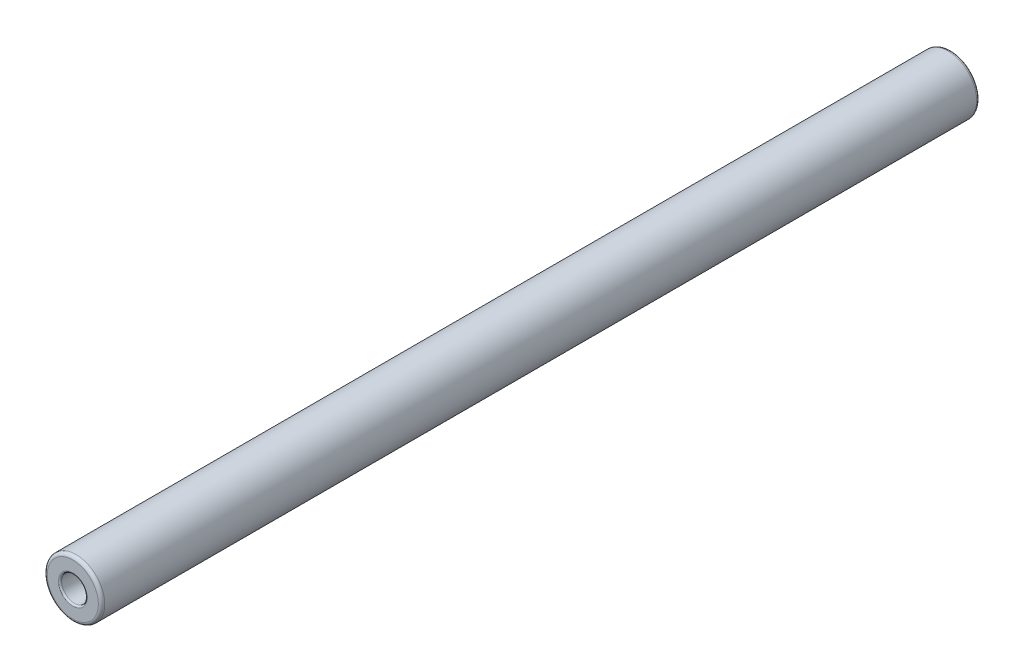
ISO-10303-21;
HEADER;
FILE_DESCRIPTION(('STEP AP214'),'2;1');
FILE_NAME('part.step','',(''),(''),'','','');
FILE_SCHEMA(('AUTOMOTIVE_DESIGN { 1 0 10303 214 1 1 1 1 }'));
ENDSEC;
DATA;
#1=APPLICATION_CONTEXT('core data for automotive mechanical design processes');
#2=APPLICATION_PROTOCOL_DEFINITION('international standard','automotive_design',2000,#1);
#3=PRODUCT_CONTEXT('',#1,'mechanical');
#4=PRODUCT('Part','Part','',(#3));
#5=PRODUCT_RELATED_PRODUCT_CATEGORY('part','',(#4));
#6=PRODUCT_DEFINITION_FORMATION('','',#4);
#7=PRODUCT_DEFINITION_CONTEXT('part definition',#1,'design');
#8=PRODUCT_DEFINITION('design','',#6,#7);
#9=PRODUCT_DEFINITION_SHAPE('','',#8);
#10=(LENGTH_UNIT() NAMED_UNIT(*) SI_UNIT(.MILLI.,.METRE.));
#11=(NAMED_UNIT(*) PLANE_ANGLE_UNIT() SI_UNIT($,.RADIAN.));
#12=(NAMED_UNIT(*) SI_UNIT($,.STERADIAN.) SOLID_ANGLE_UNIT());
#13=UNCERTAINTY_MEASURE_WITH_UNIT(LENGTH_MEASURE(1.E-05),#10,'distance_accuracy_value','');
#14=(GEOMETRIC_REPRESENTATION_CONTEXT(3) GLOBAL_UNCERTAINTY_ASSIGNED_CONTEXT((#13)) GLOBAL_UNIT_ASSIGNED_CONTEXT((#10,
#11,#12)) REPRESENTATION_CONTEXT('',''));
#15=CARTESIAN_POINT('',(0.,0.,0.));
#16=DIRECTION('',(0.,0.,1.));
#17=DIRECTION('',(1.,0.,0.));
#18=AXIS2_PLACEMENT_3D('',#15,#16,#17);
#19=CARTESIAN_POINT('',(0.,0.,0.));
#20=DIRECTION('',(0.,0.,1.));
#21=DIRECTION('',(1.,0.,0.));
#22=AXIS2_PLACEMENT_3D('',#19,#20,#21);
#23=PLANE('',#22);
#24=CARTESIAN_POINT('',(0.,0.,0.));
#25=DIRECTION('',(0.,0.,1.));
#26=DIRECTION('',(1.,0.,0.));
#27=AXIS2_PLACEMENT_3D('',#24,#25,#26);
#28=CIRCLE('',#27,9.);
#29=CARTESIAN_POINT('',(9.,0.,0.));
#30=VERTEX_POINT('',#29);
#31=EDGE_CURVE('E43',#30,#30,#28,.F.);
#32=ORIENTED_EDGE('',*,*,#31,.T.);
#33=EDGE_LOOP('',(#32));
#34=FACE_BOUND('',#33,.T.);
#35=CARTESIAN_POINT('',(0.,0.,0.));
#36=DIRECTION('',(0.,0.,1.));
#37=DIRECTION('',(1.,0.,0.));
#38=AXIS2_PLACEMENT_3D('',#35,#36,#37);
#39=CIRCLE('',#38,16.);
#40=CARTESIAN_POINT('',(16.,0.,0.));
#41=VERTEX_POINT('',#40);
#42=EDGE_CURVE('E61',#41,#41,#39,.T.);
#43=ORIENTED_EDGE('',*,*,#42,.T.);
#44=EDGE_LOOP('',(#43));
#45=FACE_BOUND('',#44,.T.);
#46=ADVANCED_FACE('F32',(#34,#45),#23,.T.);
#47=CARTESIAN_POINT('',(0.,0.,-550.));
#48=DIRECTION('',(0.,0.,1.));
#49=DIRECTION('',(1.,0.,0.));
#50=AXIS2_PLACEMENT_3D('',#47,#48,#49);
#51=PLANE('',#50);
#52=CARTESIAN_POINT('',(0.,0.,-550.));
#53=DIRECTION('',(0.,0.,1.));
#54=DIRECTION('',(1.,0.,0.));
#55=AXIS2_PLACEMENT_3D('',#52,#53,#54);
#56=CIRCLE('',#55,9.);
#57=CARTESIAN_POINT('',(9.,0.,-550.));
#58=VERTEX_POINT('',#57);
#59=EDGE_CURVE('E10',#58,#58,#56,.T.);
#60=ORIENTED_EDGE('',*,*,#59,.T.);
#61=EDGE_LOOP('',(#60));
#62=FACE_BOUND('',#61,.T.);
#63=CARTESIAN_POINT('',(0.,0.,-550.));
#64=DIRECTION('',(0.,0.,1.));
#65=DIRECTION('',(1.,0.,0.));
#66=AXIS2_PLACEMENT_3D('',#63,#64,#65);
#67=CIRCLE('',#66,16.);
#68=CARTESIAN_POINT('',(16.,0.,-550.));
#69=VERTEX_POINT('',#68);
#70=EDGE_CURVE('E52',#69,#69,#67,.F.);
#71=ORIENTED_EDGE('',*,*,#70,.T.);
#72=EDGE_LOOP('',(#71));
#73=FACE_BOUND('',#72,.T.);
#74=ADVANCED_FACE('F89',(#62,#73),#51,.F.);
#75=CARTESIAN_POINT('',(0.,0.,0.));
#76=DIRECTION('',(0.,0.,-1.));
#77=DIRECTION('',(-1.,0.,0.));
#78=AXIS2_PLACEMENT_3D('',#75,#76,#77);
#79=CYLINDRICAL_SURFACE('',#78,18.);
#80=CARTESIAN_POINT('',(0.,0.,-2.));
#81=DIRECTION('',(0.,0.,1.));
#82=DIRECTION('',(1.,0.,0.));
#83=AXIS2_PLACEMENT_3D('',#80,#81,#82);
#84=CIRCLE('',#83,18.);
#85=CARTESIAN_POINT('',(18.,0.,-2.));
#86=VERTEX_POINT('',#85);
#87=EDGE_CURVE('E55',#86,#86,#84,.F.);
#88=ORIENTED_EDGE('',*,*,#87,.T.);
#89=EDGE_LOOP('',(#88));
#90=FACE_BOUND('',#89,.T.);
#91=CARTESIAN_POINT('',(0.,0.,-548.));
#92=DIRECTION('',(0.,0.,1.));
#93=DIRECTION('',(1.,0.,0.));
#94=AXIS2_PLACEMENT_3D('',#91,#92,#93);
#95=CIRCLE('',#94,18.);
#96=CARTESIAN_POINT('',(18.,0.,-548.));
#97=VERTEX_POINT('',#96);
#98=EDGE_CURVE('E58',#97,#97,#95,.T.);
#99=ORIENTED_EDGE('',*,*,#98,.T.);
#100=EDGE_LOOP('',(#99));
#101=FACE_BOUND('',#100,.T.);
#102=ADVANCED_FACE('F86',(#90,#101),#79,.T.);
#103=CARTESIAN_POINT('',(0.,0.,-2.));
#104=DIRECTION('',(0.,0.,1.));
#105=DIRECTION('',(1.,0.,0.));
#106=AXIS2_PLACEMENT_3D('',#103,#104,#105);
#107=TOROIDAL_SURFACE('',#106,16.,2.);
#108=ORIENTED_EDGE('',*,*,#87,.F.);
#109=EDGE_LOOP('',(#108));
#110=FACE_BOUND('',#109,.T.);
#111=ORIENTED_EDGE('',*,*,#42,.F.);
#112=EDGE_LOOP('',(#111));
#113=FACE_BOUND('',#112,.T.);
#114=ADVANCED_FACE('F88',(#110,#113),#107,.T.);
#115=CARTESIAN_POINT('',(0.,0.,-548.));
#116=DIRECTION('',(0.,0.,1.));
#117=DIRECTION('',(1.,0.,0.));
#118=AXIS2_PLACEMENT_3D('',#115,#116,#117);
#119=TOROIDAL_SURFACE('',#118,16.,2.);
#120=ORIENTED_EDGE('',*,*,#70,.F.);
#121=EDGE_LOOP('',(#120));
#122=FACE_BOUND('',#121,.T.);
#123=ORIENTED_EDGE('',*,*,#98,.F.);
#124=EDGE_LOOP('',(#123));
#125=FACE_BOUND('',#124,.T.);
#126=ADVANCED_FACE('F96',(#122,#125),#119,.T.);
#127=CARTESIAN_POINT('',(0.,0.,-70.));
#128=DIRECTION('',(0.,0.,1.));
#129=DIRECTION('',(1.,0.,0.));
#130=AXIS2_PLACEMENT_3D('',#127,#128,#129);
#131=CYLINDRICAL_SURFACE('',#130,8.);
#132=CARTESIAN_POINT('',(0.,0.,-1.));
#133=DIRECTION('',(0.,0.,1.));
#134=DIRECTION('',(1.,0.,0.));
#135=AXIS2_PLACEMENT_3D('',#132,#133,#134);
#136=CIRCLE('',#135,8.);
#137=CARTESIAN_POINT('',(8.,0.,-1.));
#138=VERTEX_POINT('',#137);
#139=EDGE_CURVE('E47',#138,#138,#136,.T.);
#140=ORIENTED_EDGE('',*,*,#139,.T.);
#141=EDGE_LOOP('',(#140));
#142=FACE_BOUND('',#141,.T.);
#143=CARTESIAN_POINT('',(0.,0.,-70.));
#144=DIRECTION('',(0.,0.,1.));
#145=DIRECTION('',(1.,0.,0.));
#146=AXIS2_PLACEMENT_3D('',#143,#144,#145);
#147=CIRCLE('',#146,8.);
#148=CARTESIAN_POINT('',(8.,0.,-70.));
#149=VERTEX_POINT('',#148);
#150=EDGE_CURVE('E64',#149,#149,#147,.T.);
#151=ORIENTED_EDGE('',*,*,#150,.F.);
#152=EDGE_LOOP('',(#151));
#153=FACE_BOUND('',#152,.T.);
#154=ADVANCED_FACE('F83',(#142,#153),#131,.F.);
#155=CARTESIAN_POINT('',(0.,0.,-70.));
#156=DIRECTION('',(0.,0.,1.));
#157=DIRECTION('',(1.,0.,0.));
#158=AXIS2_PLACEMENT_3D('',#155,#156,#157);
#159=PLANE('',#158);
#160=ORIENTED_EDGE('',*,*,#150,.T.);
#161=EDGE_LOOP('',(#160));
#162=FACE_BOUND('',#161,.T.);
#163=ADVANCED_FACE('F75',(#162),#159,.T.);
#164=CARTESIAN_POINT('',(0.,0.,-480.));
#165=DIRECTION('',(0.,0.,-1.));
#166=DIRECTION('',(-1.,0.,0.));
#167=AXIS2_PLACEMENT_3D('',#164,#165,#166);
#168=CYLINDRICAL_SURFACE('',#167,8.);
#169=CARTESIAN_POINT('',(0.,0.,-549.));
#170=DIRECTION('',(0.,0.,1.));
#171=DIRECTION('',(1.,0.,0.));
#172=AXIS2_PLACEMENT_3D('',#169,#170,#171);
#173=CIRCLE('',#172,8.);
#174=CARTESIAN_POINT('',(8.,0.,-549.));
#175=VERTEX_POINT('',#174);
#176=EDGE_CURVE('E39',#175,#175,#173,.F.);
#177=ORIENTED_EDGE('',*,*,#176,.T.);
#178=EDGE_LOOP('',(#177));
#179=FACE_BOUND('',#178,.T.);
#180=CARTESIAN_POINT('',(0.,0.,-480.));
#181=DIRECTION('',(0.,0.,-1.));
#182=DIRECTION('',(-1.,0.,0.));
#183=AXIS2_PLACEMENT_3D('',#180,#181,#182);
#184=CIRCLE('',#183,8.);
#185=CARTESIAN_POINT('',(-8.,0.,-480.));
#186=VERTEX_POINT('',#185);
#187=EDGE_CURVE('E67',#186,#186,#184,.T.);
#188=ORIENTED_EDGE('',*,*,#187,.F.);
#189=EDGE_LOOP('',(#188));
#190=FACE_BOUND('',#189,.T.);
#191=ADVANCED_FACE('F73',(#179,#190),#168,.F.);
#192=CARTESIAN_POINT('',(0.,0.,-480.));
#193=DIRECTION('',(0.,0.,-1.));
#194=DIRECTION('',(-1.,0.,0.));
#195=AXIS2_PLACEMENT_3D('',#192,#193,#194);
#196=PLANE('',#195);
#197=ORIENTED_EDGE('',*,*,#187,.T.);
#198=EDGE_LOOP('',(#197));
#199=FACE_BOUND('',#198,.T.);
#200=ADVANCED_FACE('F71',(#199),#196,.T.);
#201=CARTESIAN_POINT('',(0.,0.,-1.));
#202=DIRECTION('',(0.,0.,1.));
#203=DIRECTION('',(1.,0.,0.));
#204=AXIS2_PLACEMENT_3D('',#201,#202,#203);
#205=TOROIDAL_SURFACE('',#204,9.,1.);
#206=ORIENTED_EDGE('',*,*,#31,.F.);
#207=EDGE_LOOP('',(#206));
#208=FACE_BOUND('',#207,.T.);
#209=ORIENTED_EDGE('',*,*,#139,.F.);
#210=EDGE_LOOP('',(#209));
#211=FACE_BOUND('',#210,.T.);
#212=ADVANCED_FACE('F81',(#208,#211),#205,.T.);
#213=CARTESIAN_POINT('',(0.,0.,-549.));
#214=DIRECTION('',(0.,0.,1.));
#215=DIRECTION('',(1.,0.,0.));
#216=AXIS2_PLACEMENT_3D('',#213,#214,#215);
#217=TOROIDAL_SURFACE('',#216,9.,1.);
#218=ORIENTED_EDGE('',*,*,#59,.F.);
#219=EDGE_LOOP('',(#218));
#220=FACE_BOUND('',#219,.T.);
#221=ORIENTED_EDGE('',*,*,#176,.F.);
#222=EDGE_LOOP('',(#221));
#223=FACE_BOUND('',#222,.T.);
#224=ADVANCED_FACE('F34',(#220,#223),#217,.T.);
#225=CLOSED_SHELL('',(#46,#74,#102,#114,#126,#154,#163,#191,#200,#212,#224));
#226=MANIFOLD_SOLID_BREP('B2',#225);
#227=ADVANCED_BREP_SHAPE_REPRESENTATION('',(#18,#226),#14);
#228=SHAPE_DEFINITION_REPRESENTATION(#9,#227);
ENDSEC;
END-ISO-10303-21;
